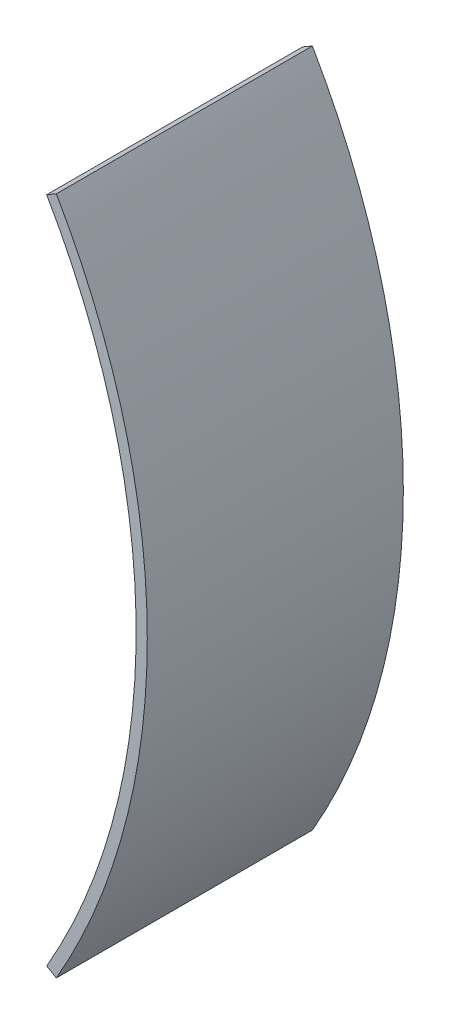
ISO-10303-21;
HEADER;
FILE_DESCRIPTION(('STEP AP214'),'2;1');
FILE_NAME('part.step','',(''),(''),'','','');
FILE_SCHEMA(('AUTOMOTIVE_DESIGN { 1 0 10303 214 1 1 1 1 }'));
ENDSEC;
DATA;
#1=APPLICATION_CONTEXT('core data for automotive mechanical design processes');
#2=APPLICATION_PROTOCOL_DEFINITION('international standard','automotive_design',2000,#1);
#3=PRODUCT_CONTEXT('',#1,'mechanical');
#4=PRODUCT('Part','Part','',(#3));
#5=PRODUCT_RELATED_PRODUCT_CATEGORY('part','',(#4));
#6=PRODUCT_DEFINITION_FORMATION('','',#4);
#7=PRODUCT_DEFINITION_CONTEXT('part definition',#1,'design');
#8=PRODUCT_DEFINITION('design','',#6,#7);
#9=PRODUCT_DEFINITION_SHAPE('','',#8);
#10=(LENGTH_UNIT() NAMED_UNIT(*) SI_UNIT(.MILLI.,.METRE.));
#11=(NAMED_UNIT(*) PLANE_ANGLE_UNIT() SI_UNIT($,.RADIAN.));
#12=(NAMED_UNIT(*) SI_UNIT($,.STERADIAN.) SOLID_ANGLE_UNIT());
#13=UNCERTAINTY_MEASURE_WITH_UNIT(LENGTH_MEASURE(1.E-05),#10,'distance_accuracy_value','');
#14=(GEOMETRIC_REPRESENTATION_CONTEXT(3) GLOBAL_UNCERTAINTY_ASSIGNED_CONTEXT((#13)) GLOBAL_UNIT_ASSIGNED_CONTEXT((#10,
#11,#12)) REPRESENTATION_CONTEXT('',''));
#15=CARTESIAN_POINT('',(0.,0.,0.));
#16=DIRECTION('',(0.,0.,1.));
#17=DIRECTION('',(1.,0.,0.));
#18=AXIS2_PLACEMENT_3D('',#15,#16,#17);
#19=CARTESIAN_POINT('',(0.,0.,0.));
#20=DIRECTION('',(0.,0.,1.));
#21=DIRECTION('',(1.,0.,0.));
#22=AXIS2_PLACEMENT_3D('',#19,#20,#21);
#23=PLANE('',#22);
#24=CARTESIAN_POINT('',(297.32137494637,-40.,0.));
#25=DIRECTION('',(0.,0.,1.));
#26=DIRECTION('',(1.,0.,0.));
#27=AXIS2_PLACEMENT_3D('',#24,#25,#26);
#28=CIRCLE('',#27,4.50000000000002);
#29=CARTESIAN_POINT('',(299.815936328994,-36.2547144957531,0.));
#30=VERTEX_POINT('',#29);
#31=CARTESIAN_POINT('',(295.84806800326,-35.748016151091,0.));
#32=VERTEX_POINT('',#31);
#33=EDGE_CURVE('E259',#30,#32,#28,.T.);
#34=ORIENTED_EDGE('',*,*,#33,.F.);
#35=CARTESIAN_POINT('',(0.,0.,0.));
#36=DIRECTION('',(0.,0.,1.));
#37=DIRECTION('',(1.,0.,0.));
#38=AXIS2_PLACEMENT_3D('',#35,#36,#37);
#39=CIRCLE('',#38,302.);
#40=CARTESIAN_POINT('',(299.815936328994,36.2547144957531,0.));
#41=VERTEX_POINT('',#40);
#42=EDGE_CURVE('E282',#30,#41,#39,.T.);
#43=ORIENTED_EDGE('',*,*,#42,.T.);
#44=CARTESIAN_POINT('',(297.32137494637,40.,0.));
#45=DIRECTION('',(0.,0.,1.));
#46=DIRECTION('',(1.,0.,0.));
#47=AXIS2_PLACEMENT_3D('',#44,#45,#46);
#48=CIRCLE('',#47,4.50000000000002);
#49=CARTESIAN_POINT('',(295.84806800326,35.748016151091,0.));
#50=VERTEX_POINT('',#49);
#51=EDGE_CURVE('E286',#50,#41,#48,.T.);
#52=ORIENTED_EDGE('',*,*,#51,.F.);
#53=CARTESIAN_POINT('',(0.,0.,0.));
#54=DIRECTION('',(0.,0.,1.));
#55=DIRECTION('',(1.,0.,0.));
#56=AXIS2_PLACEMENT_3D('',#53,#54,#55);
#57=CIRCLE('',#56,298.);
#58=EDGE_CURVE('E276',#50,#32,#57,.F.);
#59=ORIENTED_EDGE('',*,*,#58,.T.);
#60=EDGE_LOOP('',(#34,#43,#52,#59));
#61=FACE_BOUND('',#60,.T.);
#62=CARTESIAN_POINT('',(297.32137494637,40.,0.));
#63=DIRECTION('',(0.,0.,1.));
#64=DIRECTION('',(1.,0.,0.));
#65=AXIS2_PLACEMENT_3D('',#62,#63,#64);
#66=CIRCLE('',#65,1.50000000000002);
#67=CARTESIAN_POINT('',(298.82137494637,40.,0.));
#68=VERTEX_POINT('',#67);
#69=EDGE_CURVE('E318',#68,#68,#66,.T.);
#70=ORIENTED_EDGE('',*,*,#69,.T.);
#71=EDGE_LOOP('',(#70));
#72=FACE_BOUND('',#71,.T.);
#73=CARTESIAN_POINT('',(0.,0.,0.));
#74=DIRECTION('',(0.,0.,1.));
#75=DIRECTION('',(1.,0.,0.));
#76=AXIS2_PLACEMENT_3D('',#73,#74,#75);
#77=CIRCLE('',#76,300.);
#78=CARTESIAN_POINT('',(292.653012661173,-65.9864696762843,0.));
#79=VERTEX_POINT('',#78);
#80=CARTESIAN_POINT('',(259.807621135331,-150.,0.));
#81=VERTEX_POINT('',#80);
#82=EDGE_CURVE('E211',#79,#81,#77,.F.);
#83=ORIENTED_EDGE('',*,*,#82,.F.);
#84=CARTESIAN_POINT('',(287.775462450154,-64.8866951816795,0.));
#85=DIRECTION('',(0.,0.,1.));
#86=DIRECTION('',(1.,0.,0.));
#87=AXIS2_PLACEMENT_3D('',#84,#85,#86);
#88=CIRCLE('',#87,5.);
#89=CARTESIAN_POINT('',(288.833862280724,-60.,0.));
#90=VERTEX_POINT('',#89);
#91=EDGE_CURVE('E339',#79,#90,#88,.T.);
#92=ORIENTED_EDGE('',*,*,#91,.T.);
#93=CARTESIAN_POINT('',(0.,0.,0.));
#94=DIRECTION('',(0.,0.,-1.));
#95=DIRECTION('',(-1.,0.,0.));
#96=AXIS2_PLACEMENT_3D('',#93,#94,#95);
#97=CIRCLE('',#96,295.);
#98=CARTESIAN_POINT('',(288.833862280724,60.,0.));
#99=VERTEX_POINT('',#98);
#100=EDGE_CURVE('E305',#99,#90,#97,.T.);
#101=ORIENTED_EDGE('',*,*,#100,.F.);
#102=CARTESIAN_POINT('',(287.775462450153,64.8866951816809,0.));
#103=DIRECTION('',(0.,0.,1.));
#104=DIRECTION('',(1.,0.,0.));
#105=AXIS2_PLACEMENT_3D('',#102,#103,#104);
#106=CIRCLE('',#105,5.);
#107=CARTESIAN_POINT('',(292.653012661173,65.9864696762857,0.));
#108=VERTEX_POINT('',#107);
#109=EDGE_CURVE('E11',#99,#108,#106,.T.);
#110=ORIENTED_EDGE('',*,*,#109,.T.);
#111=CARTESIAN_POINT('',(0.,0.,0.));
#112=DIRECTION('',(0.,0.,1.));
#113=DIRECTION('',(1.,0.,0.));
#114=AXIS2_PLACEMENT_3D('',#111,#112,#113);
#115=CIRCLE('',#114,300.);
#116=CARTESIAN_POINT('',(259.807621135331,150.,0.));
#117=VERTEX_POINT('',#116);
#118=EDGE_CURVE('E186',#117,#108,#115,.F.);
#119=ORIENTED_EDGE('',*,*,#118,.F.);
#120=DIRECTION('',(-0.866025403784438,-0.5,0.));
#121=VECTOR('',#120,1.);
#122=CARTESIAN_POINT('',(259.807621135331,150.,0.));
#123=LINE('',#122,#121);
#124=CARTESIAN_POINT('',(264.137748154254,152.5,0.));
#125=VERTEX_POINT('',#124);
#126=EDGE_CURVE('E201',#125,#117,#123,.T.);
#127=ORIENTED_EDGE('',*,*,#126,.F.);
#128=CARTESIAN_POINT('',(0.,0.,0.));
#129=DIRECTION('',(0.,0.,1.));
#130=DIRECTION('',(1.,0.,0.));
#131=AXIS2_PLACEMENT_3D('',#128,#129,#130);
#132=CIRCLE('',#131,305.);
#133=CARTESIAN_POINT('',(264.137748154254,-152.5,0.));
#134=VERTEX_POINT('',#133);
#135=EDGE_CURVE('E325',#134,#125,#132,.T.);
#136=ORIENTED_EDGE('',*,*,#135,.F.);
#137=DIRECTION('',(0.866025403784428,-0.500000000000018,0.));
#138=VECTOR('',#137,1.);
#139=CARTESIAN_POINT('',(264.137748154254,-152.5,0.));
#140=LINE('',#139,#138);
#141=EDGE_CURVE('E204',#81,#134,#140,.T.);
#142=ORIENTED_EDGE('',*,*,#141,.F.);
#143=EDGE_LOOP('',(#83,#92,#101,#110,#119,#127,#136,#142));
#144=FACE_BOUND('',#143,.T.);
#145=CARTESIAN_POINT('',(297.32137494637,-40.,0.));
#146=DIRECTION('',(0.,0.,1.));
#147=DIRECTION('',(-1.,0.,0.));
#148=AXIS2_PLACEMENT_3D('',#145,#146,#147);
#149=CIRCLE('',#148,1.50000000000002);
#150=CARTESIAN_POINT('',(295.82137494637,-40.,0.));
#151=VERTEX_POINT('',#150);
#152=EDGE_CURVE('E314',#151,#151,#149,.T.);
#153=ORIENTED_EDGE('',*,*,#152,.T.);
#154=EDGE_LOOP('',(#153));
#155=FACE_BOUND('',#154,.T.);
#156=CARTESIAN_POINT('',(294.776713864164,-43.7114282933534,0.));
#157=VERTEX_POINT('',#156);
#158=CARTESIAN_POINT('',(298.737415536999,-44.271396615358,0.));
#159=VERTEX_POINT('',#158);
#160=EDGE_CURVE('E261',#157,#159,#28,.T.);
#161=ORIENTED_EDGE('',*,*,#160,.F.);
#162=CARTESIAN_POINT('',(292.497863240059,-57.,0.));
#163=VERTEX_POINT('',#162);
#164=EDGE_CURVE('E273',#157,#163,#57,.F.);
#165=ORIENTED_EDGE('',*,*,#164,.T.);
#166=DIRECTION('',(1.,0.,0.));
#167=VECTOR('',#166,1.);
#168=CARTESIAN_POINT('',(72.3602100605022,-57.,0.));
#169=LINE('',#168,#167);
#170=CARTESIAN_POINT('',(296.572082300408,-57.,0.));
#171=VERTEX_POINT('',#170);
#172=EDGE_CURVE('E253',#163,#171,#169,.T.);
#173=ORIENTED_EDGE('',*,*,#172,.T.);
#174=EDGE_CURVE('E272',#171,#159,#39,.T.);
#175=ORIENTED_EDGE('',*,*,#174,.T.);
#176=EDGE_LOOP('',(#161,#165,#173,#175));
#177=FACE_BOUND('',#176,.T.);
#178=CARTESIAN_POINT('',(298.737415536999,44.271396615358,0.));
#179=VERTEX_POINT('',#178);
#180=CARTESIAN_POINT('',(294.776713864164,43.7114282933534,0.));
#181=VERTEX_POINT('',#180);
#182=EDGE_CURVE('E283',#179,#181,#48,.T.);
#183=ORIENTED_EDGE('',*,*,#182,.F.);
#184=CARTESIAN_POINT('',(296.572082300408,57.,0.));
#185=VERTEX_POINT('',#184);
#186=EDGE_CURVE('E279',#179,#185,#39,.T.);
#187=ORIENTED_EDGE('',*,*,#186,.T.);
#188=DIRECTION('',(-1.,0.,0.));
#189=VECTOR('',#188,1.);
#190=CARTESIAN_POINT('',(72.3602100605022,57.,0.));
#191=LINE('',#190,#189);
#192=CARTESIAN_POINT('',(292.497863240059,57.,0.));
#193=VERTEX_POINT('',#192);
#194=EDGE_CURVE('E241',#185,#193,#191,.T.);
#195=ORIENTED_EDGE('',*,*,#194,.T.);
#196=EDGE_CURVE('E231',#193,#181,#57,.F.);
#197=ORIENTED_EDGE('',*,*,#196,.T.);
#198=EDGE_LOOP('',(#183,#187,#195,#197));
#199=FACE_BOUND('',#198,.T.);
#200=ADVANCED_FACE('F33',(#61,#72,#144,#155,#177,#199),#23,.F.);
#201=CARTESIAN_POINT('',(0.,0.,15.));
#202=DIRECTION('',(0.,0.,1.));
#203=DIRECTION('',(1.,0.,0.));
#204=AXIS2_PLACEMENT_3D('',#201,#202,#203);
#205=PLANE('',#204);
#206=CARTESIAN_POINT('',(0.,0.,15.));
#207=DIRECTION('',(0.,0.,-1.));
#208=DIRECTION('',(1.,0.,0.));
#209=AXIS2_PLACEMENT_3D('',#206,#207,#208);
#210=CIRCLE('',#209,300.);
#211=CARTESIAN_POINT('',(292.653012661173,65.9864696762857,15.));
#212=VERTEX_POINT('',#211);
#213=CARTESIAN_POINT('',(297.117659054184,41.4861022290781,15.));
#214=VERTEX_POINT('',#213);
#215=EDGE_CURVE('E56',#212,#214,#210,.T.);
#216=ORIENTED_EDGE('',*,*,#215,.F.);
#217=CARTESIAN_POINT('',(287.775462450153,64.8866951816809,15.));
#218=DIRECTION('',(0.,0.,1.));
#219=DIRECTION('',(1.,0.,0.));
#220=AXIS2_PLACEMENT_3D('',#217,#218,#219);
#221=CIRCLE('',#220,5.);
#222=CARTESIAN_POINT('',(288.833862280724,60.,15.));
#223=VERTEX_POINT('',#222);
#224=EDGE_CURVE('E41',#212,#223,#221,.F.);
#225=ORIENTED_EDGE('',*,*,#224,.T.);
#226=CARTESIAN_POINT('',(0.,0.,15.));
#227=DIRECTION('',(0.,0.,-1.));
#228=DIRECTION('',(-1.,0.,0.));
#229=AXIS2_PLACEMENT_3D('',#226,#227,#228);
#230=CIRCLE('',#229,295.);
#231=CARTESIAN_POINT('',(288.833862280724,-60.,15.));
#232=VERTEX_POINT('',#231);
#233=EDGE_CURVE('E306',#223,#232,#230,.T.);
#234=ORIENTED_EDGE('',*,*,#233,.T.);
#235=CARTESIAN_POINT('',(287.775462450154,-64.8866951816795,15.));
#236=DIRECTION('',(0.,0.,1.));
#237=DIRECTION('',(1.,0.,0.));
#238=AXIS2_PLACEMENT_3D('',#235,#236,#237);
#239=CIRCLE('',#238,5.);
#240=CARTESIAN_POINT('',(292.653012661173,-65.9864696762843,15.));
#241=VERTEX_POINT('',#240);
#242=EDGE_CURVE('E337',#232,#241,#239,.F.);
#243=ORIENTED_EDGE('',*,*,#242,.T.);
#244=CARTESIAN_POINT('',(297.117659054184,-41.4861022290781,15.));
#245=VERTEX_POINT('',#244);
#246=EDGE_CURVE('E48',#245,#241,#210,.T.);
#247=ORIENTED_EDGE('',*,*,#246,.F.);
#248=CARTESIAN_POINT('',(297.32137494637,-40.,15.));
#249=DIRECTION('',(0.,0.,1.));
#250=DIRECTION('',(-1.,0.,0.));
#251=AXIS2_PLACEMENT_3D('',#248,#249,#250);
#252=CIRCLE('',#251,1.50000000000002);
#253=CARTESIAN_POINT('',(297.517657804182,-38.5128977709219,15.));
#254=VERTEX_POINT('',#253);
#255=EDGE_CURVE('E319',#254,#245,#252,.T.);
#256=ORIENTED_EDGE('',*,*,#255,.F.);
#257=CARTESIAN_POINT('',(297.517657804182,38.5128977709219,15.));
#258=VERTEX_POINT('',#257);
#259=EDGE_CURVE('E349',#258,#254,#210,.T.);
#260=ORIENTED_EDGE('',*,*,#259,.F.);
#261=CARTESIAN_POINT('',(297.32137494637,40.,15.));
#262=DIRECTION('',(0.,0.,1.));
#263=DIRECTION('',(1.,0.,0.));
#264=AXIS2_PLACEMENT_3D('',#261,#262,#263);
#265=CIRCLE('',#264,1.50000000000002);
#266=EDGE_CURVE('E322',#214,#258,#265,.T.);
#267=ORIENTED_EDGE('',*,*,#266,.F.);
#268=EDGE_LOOP('',(#216,#225,#234,#243,#247,#256,#260,#267));
#269=FACE_BOUND('',#268,.T.);
#270=ADVANCED_FACE('F341',(#269),#205,.T.);
#271=CARTESIAN_POINT('',(0.,0.,15.));
#272=DIRECTION('',(0.,0.,-1.));
#273=DIRECTION('',(-1.,0.,0.));
#274=AXIS2_PLACEMENT_3D('',#271,#272,#273);
#275=CYLINDRICAL_SURFACE('',#274,305.);
#276=ORIENTED_EDGE('',*,*,#135,.T.);
#277=DIRECTION('',(0.,0.,-1.));
#278=VECTOR('',#277,1.);
#279=CARTESIAN_POINT('',(264.137748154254,152.5,115.));
#280=LINE('',#279,#278);
#281=CARTESIAN_POINT('',(264.137748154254,152.5,115.));
#282=VERTEX_POINT('',#281);
#283=EDGE_CURVE('E194',#282,#125,#280,.T.);
#284=ORIENTED_EDGE('',*,*,#283,.F.);
#285=CARTESIAN_POINT('',(0.,0.,115.));
#286=DIRECTION('',(0.,0.,1.));
#287=DIRECTION('',(1.,0.,0.));
#288=AXIS2_PLACEMENT_3D('',#285,#286,#287);
#289=CIRCLE('',#288,305.);
#290=CARTESIAN_POINT('',(264.137748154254,-152.5,115.));
#291=VERTEX_POINT('',#290);
#292=EDGE_CURVE('E220',#291,#282,#289,.T.);
#293=ORIENTED_EDGE('',*,*,#292,.F.);
#294=DIRECTION('',(0.,0.,-1.));
#295=VECTOR('',#294,1.);
#296=CARTESIAN_POINT('',(264.137748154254,-152.5,115.));
#297=LINE('',#296,#295);
#298=EDGE_CURVE('E225',#291,#134,#297,.T.);
#299=ORIENTED_EDGE('',*,*,#298,.T.);
#300=EDGE_LOOP('',(#276,#284,#293,#299));
#301=FACE_BOUND('',#300,.T.);
#302=ADVANCED_FACE('F384',(#301),#275,.T.);
#303=CARTESIAN_POINT('',(297.32137494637,40.,15.));
#304=DIRECTION('',(0.,0.,-1.));
#305=DIRECTION('',(-1.,0.,0.));
#306=AXIS2_PLACEMENT_3D('',#303,#304,#305);
#307=CYLINDRICAL_SURFACE('',#306,1.50000000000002);
#308=ORIENTED_EDGE('',*,*,#266,.T.);
#309=EDGE_CURVE('E326',#258,#214,#265,.T.);
#310=ORIENTED_EDGE('',*,*,#309,.T.);
#311=EDGE_LOOP('',(#308,#310));
#312=FACE_BOUND('',#311,.T.);
#313=ORIENTED_EDGE('',*,*,#69,.F.);
#314=EDGE_LOOP('',(#313));
#315=FACE_BOUND('',#314,.T.);
#316=ADVANCED_FACE('F354',(#312,#315),#307,.F.);
#317=CARTESIAN_POINT('',(297.32137494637,-40.,15.));
#318=DIRECTION('',(0.,0.,-1.));
#319=DIRECTION('',(-1.,0.,0.));
#320=AXIS2_PLACEMENT_3D('',#317,#318,#319);
#321=CYLINDRICAL_SURFACE('',#320,1.50000000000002);
#322=EDGE_CURVE('E315',#245,#254,#252,.T.);
#323=ORIENTED_EDGE('',*,*,#322,.T.);
#324=ORIENTED_EDGE('',*,*,#255,.T.);
#325=EDGE_LOOP('',(#323,#324));
#326=FACE_BOUND('',#325,.T.);
#327=ORIENTED_EDGE('',*,*,#152,.F.);
#328=EDGE_LOOP('',(#327));
#329=FACE_BOUND('',#328,.T.);
#330=ADVANCED_FACE('F447',(#326,#329),#321,.F.);
#331=CARTESIAN_POINT('',(0.,0.,15.));
#332=DIRECTION('',(0.,0.,-1.));
#333=DIRECTION('',(-1.,0.,0.));
#334=AXIS2_PLACEMENT_3D('',#331,#332,#333);
#335=CYLINDRICAL_SURFACE('',#334,295.);
#336=ORIENTED_EDGE('',*,*,#233,.F.);
#337=DIRECTION('',(0.,0.,-1.));
#338=VECTOR('',#337,1.);
#339=CARTESIAN_POINT('',(288.833862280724,60.,15.));
#340=LINE('',#339,#338);
#341=EDGE_CURVE('E330',#99,#223,#340,.F.);
#342=ORIENTED_EDGE('',*,*,#341,.F.);
#343=ORIENTED_EDGE('',*,*,#100,.T.);
#344=DIRECTION('',(0.,0.,-1.));
#345=VECTOR('',#344,1.);
#346=CARTESIAN_POINT('',(288.833862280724,-60.,15.));
#347=LINE('',#346,#345);
#348=EDGE_CURVE('E309',#232,#90,#347,.T.);
#349=ORIENTED_EDGE('',*,*,#348,.F.);
#350=EDGE_LOOP('',(#336,#342,#343,#349));
#351=FACE_BOUND('',#350,.T.);
#352=ADVANCED_FACE('F345',(#351),#335,.F.);
#353=CARTESIAN_POINT('',(297.32137494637,40.,15.));
#354=DIRECTION('',(0.,0.,-1.));
#355=DIRECTION('',(-1.,0.,0.));
#356=AXIS2_PLACEMENT_3D('',#353,#354,#355);
#357=CYLINDRICAL_SURFACE('',#356,4.50000000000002);
#358=CARTESIAN_POINT('',(297.32137494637,40.,12.));
#359=DIRECTION('',(0.,0.,1.));
#360=DIRECTION('',(1.,0.,0.));
#361=AXIS2_PLACEMENT_3D('',#358,#359,#360);
#362=CIRCLE('',#361,4.50000000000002);
#363=CARTESIAN_POINT('',(295.848068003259,35.7480161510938,12.));
#364=VERTEX_POINT('',#363);
#365=CARTESIAN_POINT('',(299.815936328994,36.2547144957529,12.));
#366=VERTEX_POINT('',#365);
#367=EDGE_CURVE('E250',#364,#366,#362,.T.);
#368=ORIENTED_EDGE('',*,*,#367,.F.);
#369=DIRECTION('',(0.,0.,1.));
#370=VECTOR('',#369,1.);
#371=CARTESIAN_POINT('',(295.84806800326,35.7480161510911,15.));
#372=LINE('',#371,#370);
#373=EDGE_CURVE('E296',#364,#50,#372,.F.);
#374=ORIENTED_EDGE('',*,*,#373,.T.);
#375=ORIENTED_EDGE('',*,*,#51,.T.);
#376=DIRECTION('',(0.,0.,-1.));
#377=VECTOR('',#376,1.);
#378=CARTESIAN_POINT('',(299.815936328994,36.2547144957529,15.));
#379=LINE('',#378,#377);
#380=EDGE_CURVE('E300',#366,#41,#379,.T.);
#381=ORIENTED_EDGE('',*,*,#380,.F.);
#382=EDGE_LOOP('',(#368,#374,#375,#381));
#383=FACE_BOUND('',#382,.T.);
#384=ADVANCED_FACE('F371',(#383),#357,.T.);
#385=CARTESIAN_POINT('',(0.,0.,12.));
#386=DIRECTION('',(0.,0.,1.));
#387=DIRECTION('',(1.,0.,0.));
#388=AXIS2_PLACEMENT_3D('',#385,#386,#387);
#389=PLANE('',#388);
#390=CARTESIAN_POINT('',(0.,0.,12.));
#391=DIRECTION('',(0.,0.,1.));
#392=DIRECTION('',(1.,0.,0.));
#393=AXIS2_PLACEMENT_3D('',#390,#391,#392);
#394=CIRCLE('',#393,298.);
#395=CARTESIAN_POINT('',(295.84806800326,-35.748016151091,12.));
#396=VERTEX_POINT('',#395);
#397=EDGE_CURVE('E236',#364,#396,#394,.F.);
#398=ORIENTED_EDGE('',*,*,#397,.F.);
#399=ORIENTED_EDGE('',*,*,#367,.T.);
#400=CARTESIAN_POINT('',(0.,0.,12.));
#401=DIRECTION('',(0.,0.,1.));
#402=DIRECTION('',(1.,0.,0.));
#403=AXIS2_PLACEMENT_3D('',#400,#401,#402);
#404=CIRCLE('',#403,302.);
#405=CARTESIAN_POINT('',(299.815936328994,-36.2547144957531,12.));
#406=VERTEX_POINT('',#405);
#407=EDGE_CURVE('E246',#406,#366,#404,.T.);
#408=ORIENTED_EDGE('',*,*,#407,.F.);
#409=CARTESIAN_POINT('',(297.32137494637,-40.,12.));
#410=DIRECTION('',(0.,0.,1.));
#411=DIRECTION('',(1.,0.,0.));
#412=AXIS2_PLACEMENT_3D('',#409,#410,#411);
#413=CIRCLE('',#412,4.50000000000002);
#414=EDGE_CURVE('E255',#406,#396,#413,.T.);
#415=ORIENTED_EDGE('',*,*,#414,.T.);
#416=EDGE_LOOP('',(#398,#399,#408,#415));
#417=FACE_BOUND('',#416,.T.);
#418=ADVANCED_FACE('F413',(#417),#389,.F.);
#419=CARTESIAN_POINT('',(0.,0.,15.));
#420=DIRECTION('',(0.,0.,-1.));
#421=DIRECTION('',(-1.,0.,0.));
#422=AXIS2_PLACEMENT_3D('',#419,#420,#421);
#423=CYLINDRICAL_SURFACE('',#422,298.);
#424=ORIENTED_EDGE('',*,*,#397,.T.);
#425=DIRECTION('',(0.,0.,1.));
#426=VECTOR('',#425,1.);
#427=CARTESIAN_POINT('',(295.848068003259,-35.7480161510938,15.));
#428=LINE('',#427,#426);
#429=EDGE_CURVE('E290',#396,#32,#428,.F.);
#430=ORIENTED_EDGE('',*,*,#429,.T.);
#431=ORIENTED_EDGE('',*,*,#58,.F.);
#432=ORIENTED_EDGE('',*,*,#373,.F.);
#433=EDGE_LOOP('',(#424,#430,#431,#432));
#434=FACE_BOUND('',#433,.T.);
#435=ADVANCED_FACE('F416',(#434),#423,.T.);
#436=CARTESIAN_POINT('',(0.,0.,15.));
#437=DIRECTION('',(0.,0.,-1.));
#438=DIRECTION('',(-1.,0.,0.));
#439=AXIS2_PLACEMENT_3D('',#436,#437,#438);
#440=CYLINDRICAL_SURFACE('',#439,302.);
#441=ORIENTED_EDGE('',*,*,#380,.T.);
#442=ORIENTED_EDGE('',*,*,#42,.F.);
#443=DIRECTION('',(0.,0.,-1.));
#444=VECTOR('',#443,1.);
#445=CARTESIAN_POINT('',(299.815936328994,-36.2547144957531,15.));
#446=LINE('',#445,#444);
#447=EDGE_CURVE('E294',#406,#30,#446,.T.);
#448=ORIENTED_EDGE('',*,*,#447,.F.);
#449=ORIENTED_EDGE('',*,*,#407,.T.);
#450=EDGE_LOOP('',(#441,#442,#448,#449));
#451=FACE_BOUND('',#450,.T.);
#452=ADVANCED_FACE('F429',(#451),#440,.F.);
#453=CARTESIAN_POINT('',(297.32137494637,-40.,15.));
#454=DIRECTION('',(0.,0.,-1.));
#455=DIRECTION('',(-1.,0.,0.));
#456=AXIS2_PLACEMENT_3D('',#453,#454,#455);
#457=CYLINDRICAL_SURFACE('',#456,4.50000000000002);
#458=ORIENTED_EDGE('',*,*,#447,.T.);
#459=ORIENTED_EDGE('',*,*,#33,.T.);
#460=ORIENTED_EDGE('',*,*,#429,.F.);
#461=ORIENTED_EDGE('',*,*,#414,.F.);
#462=EDGE_LOOP('',(#458,#459,#460,#461));
#463=FACE_BOUND('',#462,.T.);
#464=ADVANCED_FACE('F440',(#463),#457,.T.);
#465=CARTESIAN_POINT('',(294.776713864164,-43.7114282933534,12.));
#466=VERTEX_POINT('',#465);
#467=CARTESIAN_POINT('',(298.737415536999,-44.271396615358,12.));
#468=VERTEX_POINT('',#467);
#469=EDGE_CURVE('E258',#466,#468,#413,.T.);
#470=ORIENTED_EDGE('',*,*,#469,.T.);
#471=CARTESIAN_POINT('',(296.572082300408,-57.,12.));
#472=VERTEX_POINT('',#471);
#473=EDGE_CURVE('E242',#472,#468,#404,.T.);
#474=ORIENTED_EDGE('',*,*,#473,.F.);
#475=DIRECTION('',(1.,0.,0.));
#476=VECTOR('',#475,1.);
#477=CARTESIAN_POINT('',(72.3602100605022,-57.,12.));
#478=LINE('',#477,#476);
#479=CARTESIAN_POINT('',(292.497863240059,-57.,12.));
#480=VERTEX_POINT('',#479);
#481=EDGE_CURVE('E238',#480,#472,#478,.T.);
#482=ORIENTED_EDGE('',*,*,#481,.F.);
#483=EDGE_CURVE('E237',#466,#480,#394,.F.);
#484=ORIENTED_EDGE('',*,*,#483,.F.);
#485=EDGE_LOOP('',(#470,#474,#482,#484));
#486=FACE_BOUND('',#485,.T.);
#487=ADVANCED_FACE('F419',(#486),#389,.F.);
#488=CARTESIAN_POINT('',(72.3602100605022,-57.,15.));
#489=DIRECTION('',(0.,1.,0.));
#490=DIRECTION('',(0.,0.,1.));
#491=AXIS2_PLACEMENT_3D('',#488,#489,#490);
#492=PLANE('',#491);
#493=ORIENTED_EDGE('',*,*,#481,.T.);
#494=DIRECTION('',(0.,0.,-1.));
#495=VECTOR('',#494,1.);
#496=CARTESIAN_POINT('',(296.572082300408,-57.,12.));
#497=LINE('',#496,#495);
#498=EDGE_CURVE('E262',#472,#171,#497,.T.);
#499=ORIENTED_EDGE('',*,*,#498,.T.);
#500=ORIENTED_EDGE('',*,*,#172,.F.);
#501=DIRECTION('',(0.,0.,-1.));
#502=VECTOR('',#501,1.);
#503=CARTESIAN_POINT('',(292.497863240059,-57.,12.));
#504=LINE('',#503,#502);
#505=EDGE_CURVE('E235',#480,#163,#504,.T.);
#506=ORIENTED_EDGE('',*,*,#505,.F.);
#507=EDGE_LOOP('',(#493,#499,#500,#506));
#508=FACE_BOUND('',#507,.T.);
#509=ADVANCED_FACE('F420',(#508),#492,.T.);
#510=DIRECTION('',(0.,0.,-1.));
#511=VECTOR('',#510,1.);
#512=CARTESIAN_POINT('',(298.737415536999,-44.2713966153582,15.));
#513=LINE('',#512,#511);
#514=EDGE_CURVE('E292',#468,#159,#513,.T.);
#515=ORIENTED_EDGE('',*,*,#514,.T.);
#516=ORIENTED_EDGE('',*,*,#174,.F.);
#517=ORIENTED_EDGE('',*,*,#498,.F.);
#518=ORIENTED_EDGE('',*,*,#473,.T.);
#519=EDGE_LOOP('',(#515,#516,#517,#518));
#520=FACE_BOUND('',#519,.T.);
#521=ADVANCED_FACE('F423',(#520),#440,.F.);
#522=ORIENTED_EDGE('',*,*,#469,.F.);
#523=DIRECTION('',(0.,0.,1.));
#524=VECTOR('',#523,1.);
#525=CARTESIAN_POINT('',(294.776713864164,-43.7114282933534,15.));
#526=LINE('',#525,#524);
#527=EDGE_CURVE('E269',#466,#157,#526,.F.);
#528=ORIENTED_EDGE('',*,*,#527,.T.);
#529=ORIENTED_EDGE('',*,*,#160,.T.);
#530=ORIENTED_EDGE('',*,*,#514,.F.);
#531=EDGE_LOOP('',(#522,#528,#529,#530));
#532=FACE_BOUND('',#531,.T.);
#533=ADVANCED_FACE('F427',(#532),#457,.T.);
#534=ORIENTED_EDGE('',*,*,#483,.T.);
#535=ORIENTED_EDGE('',*,*,#505,.T.);
#536=ORIENTED_EDGE('',*,*,#164,.F.);
#537=ORIENTED_EDGE('',*,*,#527,.F.);
#538=EDGE_LOOP('',(#534,#535,#536,#537));
#539=FACE_BOUND('',#538,.T.);
#540=ADVANCED_FACE('F432',(#539),#423,.T.);
#541=CARTESIAN_POINT('',(72.3602100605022,57.,15.));
#542=DIRECTION('',(0.,-1.,0.));
#543=DIRECTION('',(0.,0.,-1.));
#544=AXIS2_PLACEMENT_3D('',#541,#542,#543);
#545=PLANE('',#544);
#546=ORIENTED_EDGE('',*,*,#194,.F.);
#547=DIRECTION('',(0.,0.,-1.));
#548=VECTOR('',#547,1.);
#549=CARTESIAN_POINT('',(296.572082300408,57.,12.));
#550=LINE('',#549,#548);
#551=CARTESIAN_POINT('',(296.572082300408,57.,12.));
#552=VERTEX_POINT('',#551);
#553=EDGE_CURVE('E249',#552,#185,#550,.T.);
#554=ORIENTED_EDGE('',*,*,#553,.F.);
#555=DIRECTION('',(-1.,0.,0.));
#556=VECTOR('',#555,1.);
#557=CARTESIAN_POINT('',(72.3602100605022,57.,12.));
#558=LINE('',#557,#556);
#559=CARTESIAN_POINT('',(292.497863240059,57.,12.));
#560=VERTEX_POINT('',#559);
#561=EDGE_CURVE('E245',#552,#560,#558,.T.);
#562=ORIENTED_EDGE('',*,*,#561,.T.);
#563=DIRECTION('',(0.,0.,-1.));
#564=VECTOR('',#563,1.);
#565=CARTESIAN_POINT('',(292.497863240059,57.,0.));
#566=LINE('',#565,#564);
#567=EDGE_CURVE('E264',#193,#560,#566,.F.);
#568=ORIENTED_EDGE('',*,*,#567,.F.);
#569=EDGE_LOOP('',(#546,#554,#562,#568));
#570=FACE_BOUND('',#569,.T.);
#571=ADVANCED_FACE('F430',(#570),#545,.T.);
#572=CARTESIAN_POINT('',(294.776713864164,43.7114282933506,12.));
#573=VERTEX_POINT('',#572);
#574=EDGE_CURVE('E232',#560,#573,#394,.F.);
#575=ORIENTED_EDGE('',*,*,#574,.F.);
#576=ORIENTED_EDGE('',*,*,#561,.F.);
#577=CARTESIAN_POINT('',(298.737415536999,44.2713966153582,12.));
#578=VERTEX_POINT('',#577);
#579=EDGE_CURVE('E240',#578,#552,#404,.T.);
#580=ORIENTED_EDGE('',*,*,#579,.F.);
#581=EDGE_CURVE('E254',#578,#573,#362,.T.);
#582=ORIENTED_EDGE('',*,*,#581,.T.);
#583=EDGE_LOOP('',(#575,#576,#580,#582));
#584=FACE_BOUND('',#583,.T.);
#585=ADVANCED_FACE('F418',(#584),#389,.F.);
#586=DIRECTION('',(0.,0.,1.));
#587=VECTOR('',#586,1.);
#588=CARTESIAN_POINT('',(294.776713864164,43.7114282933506,15.));
#589=LINE('',#588,#587);
#590=EDGE_CURVE('E298',#573,#181,#589,.F.);
#591=ORIENTED_EDGE('',*,*,#590,.T.);
#592=ORIENTED_EDGE('',*,*,#196,.F.);
#593=ORIENTED_EDGE('',*,*,#567,.T.);
#594=ORIENTED_EDGE('',*,*,#574,.T.);
#595=EDGE_LOOP('',(#591,#592,#593,#594));
#596=FACE_BOUND('',#595,.T.);
#597=ADVANCED_FACE('F444',(#596),#423,.T.);
#598=ORIENTED_EDGE('',*,*,#579,.T.);
#599=ORIENTED_EDGE('',*,*,#553,.T.);
#600=ORIENTED_EDGE('',*,*,#186,.F.);
#601=DIRECTION('',(0.,0.,-1.));
#602=VECTOR('',#601,1.);
#603=CARTESIAN_POINT('',(298.737415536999,44.271396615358,15.));
#604=LINE('',#603,#602);
#605=EDGE_CURVE('E303',#578,#179,#604,.T.);
#606=ORIENTED_EDGE('',*,*,#605,.F.);
#607=EDGE_LOOP('',(#598,#599,#600,#606));
#608=FACE_BOUND('',#607,.T.);
#609=ADVANCED_FACE('F368',(#608),#440,.F.);
#610=ORIENTED_EDGE('',*,*,#605,.T.);
#611=ORIENTED_EDGE('',*,*,#182,.T.);
#612=ORIENTED_EDGE('',*,*,#590,.F.);
#613=ORIENTED_EDGE('',*,*,#581,.F.);
#614=EDGE_LOOP('',(#610,#611,#612,#613));
#615=FACE_BOUND('',#614,.T.);
#616=ADVANCED_FACE('F359',(#615),#357,.T.);
#617=CARTESIAN_POINT('',(0.,0.,15.));
#618=DIRECTION('',(0.,0.,1.));
#619=DIRECTION('',(1.,0.,0.));
#620=AXIS2_PLACEMENT_3D('',#617,#618,#619);
#621=PLANE('',#620);
#622=ORIENTED_EDGE('',*,*,#309,.F.);
#623=EDGE_CURVE('E218',#214,#258,#210,.T.);
#624=ORIENTED_EDGE('',*,*,#623,.F.);
#625=EDGE_LOOP('',(#622,#624));
#626=FACE_BOUND('',#625,.T.);
#627=ADVANCED_FACE('F357',(#626),#621,.F.);
#628=CARTESIAN_POINT('',(0.,0.,115.));
#629=DIRECTION('',(0.,0.,-1.));
#630=DIRECTION('',(-1.,0.,0.));
#631=AXIS2_PLACEMENT_3D('',#628,#629,#630);
#632=CYLINDRICAL_SURFACE('',#631,300.);
#633=ORIENTED_EDGE('',*,*,#246,.T.);
#634=DIRECTION('',(0.,0.,-1.));
#635=VECTOR('',#634,1.);
#636=CARTESIAN_POINT('',(292.653012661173,-65.9864696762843,115.));
#637=LINE('',#636,#635);
#638=EDGE_CURVE('E335',#241,#79,#637,.T.);
#639=ORIENTED_EDGE('',*,*,#638,.T.);
#640=ORIENTED_EDGE('',*,*,#82,.T.);
#641=DIRECTION('',(0.,0.,-1.));
#642=VECTOR('',#641,1.);
#643=CARTESIAN_POINT('',(259.807621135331,-150.,115.));
#644=LINE('',#643,#642);
#645=CARTESIAN_POINT('',(259.807621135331,-150.,115.));
#646=VERTEX_POINT('',#645);
#647=EDGE_CURVE('E228',#646,#81,#644,.T.);
#648=ORIENTED_EDGE('',*,*,#647,.F.);
#649=CARTESIAN_POINT('',(0.,0.,115.));
#650=DIRECTION('',(0.,0.,-1.));
#651=DIRECTION('',(1.,0.,0.));
#652=AXIS2_PLACEMENT_3D('',#649,#650,#651);
#653=CIRCLE('',#652,300.);
#654=CARTESIAN_POINT('',(259.807621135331,150.,115.));
#655=VERTEX_POINT('',#654);
#656=EDGE_CURVE('E190',#655,#646,#653,.T.);
#657=ORIENTED_EDGE('',*,*,#656,.F.);
#658=DIRECTION('',(0.,0.,-1.));
#659=VECTOR('',#658,1.);
#660=CARTESIAN_POINT('',(259.807621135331,150.,115.));
#661=LINE('',#660,#659);
#662=EDGE_CURVE('E182',#655,#117,#661,.T.);
#663=ORIENTED_EDGE('',*,*,#662,.T.);
#664=ORIENTED_EDGE('',*,*,#118,.T.);
#665=DIRECTION('',(0.,0.,-1.));
#666=VECTOR('',#665,1.);
#667=CARTESIAN_POINT('',(292.653012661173,65.9864696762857,115.));
#668=LINE('',#667,#666);
#669=EDGE_CURVE('E333',#108,#212,#668,.F.);
#670=ORIENTED_EDGE('',*,*,#669,.T.);
#671=ORIENTED_EDGE('',*,*,#215,.T.);
#672=ORIENTED_EDGE('',*,*,#623,.T.);
#673=ORIENTED_EDGE('',*,*,#259,.T.);
#674=EDGE_CURVE('E213',#254,#245,#210,.T.);
#675=ORIENTED_EDGE('',*,*,#674,.T.);
#676=EDGE_LOOP('',(#633,#639,#640,#648,#657,#663,#664,#670,#671,#672,#673,#675));
#677=FACE_BOUND('',#676,.T.);
#678=ADVANCED_FACE('F184',(#677),#632,.F.);
#679=CARTESIAN_POINT('',(259.807621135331,-150.,115.));
#680=DIRECTION('',(0.5,0.866025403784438,0.));
#681=DIRECTION('',(-0.866025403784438,0.5,0.));
#682=AXIS2_PLACEMENT_3D('',#679,#680,#681);
#683=PLANE('',#682);
#684=ORIENTED_EDGE('',*,*,#647,.T.);
#685=ORIENTED_EDGE('',*,*,#141,.T.);
#686=ORIENTED_EDGE('',*,*,#298,.F.);
#687=DIRECTION('',(0.866025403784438,-0.5,0.));
#688=VECTOR('',#687,1.);
#689=CARTESIAN_POINT('',(259.807621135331,-150.,115.));
#690=LINE('',#689,#688);
#691=EDGE_CURVE('E217',#646,#291,#690,.T.);
#692=ORIENTED_EDGE('',*,*,#691,.F.);
#693=EDGE_LOOP('',(#684,#685,#686,#692));
#694=FACE_BOUND('',#693,.T.);
#695=ADVANCED_FACE('F366',(#694),#683,.F.);
#696=CARTESIAN_POINT('',(259.807621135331,150.,115.));
#697=DIRECTION('',(0.500000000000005,-0.866025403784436,0.));
#698=DIRECTION('',(0.866025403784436,0.500000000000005,0.));
#699=AXIS2_PLACEMENT_3D('',#696,#697,#698);
#700=PLANE('',#699);
#701=ORIENTED_EDGE('',*,*,#283,.T.);
#702=ORIENTED_EDGE('',*,*,#126,.T.);
#703=ORIENTED_EDGE('',*,*,#662,.F.);
#704=DIRECTION('',(-0.866025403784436,-0.500000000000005,0.));
#705=VECTOR('',#704,1.);
#706=CARTESIAN_POINT('',(259.807621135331,150.,115.));
#707=LINE('',#706,#705);
#708=EDGE_CURVE('E195',#282,#655,#707,.T.);
#709=ORIENTED_EDGE('',*,*,#708,.F.);
#710=EDGE_LOOP('',(#701,#702,#703,#709));
#711=FACE_BOUND('',#710,.T.);
#712=ADVANCED_FACE('F207',(#711),#700,.F.);
#713=CARTESIAN_POINT('',(0.,0.,115.));
#714=DIRECTION('',(0.,0.,1.));
#715=DIRECTION('',(1.,0.,0.));
#716=AXIS2_PLACEMENT_3D('',#713,#714,#715);
#717=PLANE('',#716);
#718=ORIENTED_EDGE('',*,*,#656,.T.);
#719=ORIENTED_EDGE('',*,*,#691,.T.);
#720=ORIENTED_EDGE('',*,*,#292,.T.);
#721=ORIENTED_EDGE('',*,*,#708,.T.);
#722=EDGE_LOOP('',(#718,#719,#720,#721));
#723=FACE_BOUND('',#722,.T.);
#724=ADVANCED_FACE('F376',(#723),#717,.T.);
#725=ORIENTED_EDGE('',*,*,#322,.F.);
#726=ORIENTED_EDGE('',*,*,#674,.F.);
#727=EDGE_LOOP('',(#725,#726));
#728=FACE_BOUND('',#727,.T.);
#729=ADVANCED_FACE('F361',(#728),#621,.F.);
#730=CARTESIAN_POINT('',(287.775462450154,-64.8866951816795,115.));
#731=DIRECTION('',(0.,0.,1.));
#732=DIRECTION('',(1.,0.,0.));
#733=AXIS2_PLACEMENT_3D('',#730,#731,#732);
#734=CYLINDRICAL_SURFACE('',#733,5.);
#735=ORIENTED_EDGE('',*,*,#91,.F.);
#736=ORIENTED_EDGE('',*,*,#638,.F.);
#737=ORIENTED_EDGE('',*,*,#242,.F.);
#738=ORIENTED_EDGE('',*,*,#348,.T.);
#739=EDGE_LOOP('',(#735,#736,#737,#738));
#740=FACE_BOUND('',#739,.T.);
#741=ADVANCED_FACE('F375',(#740),#734,.F.);
#742=CARTESIAN_POINT('',(287.775462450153,64.8866951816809,15.));
#743=DIRECTION('',(0.,0.,1.));
#744=DIRECTION('',(1.,0.,0.));
#745=AXIS2_PLACEMENT_3D('',#742,#743,#744);
#746=CYLINDRICAL_SURFACE('',#745,5.);
#747=ORIENTED_EDGE('',*,*,#109,.F.);
#748=ORIENTED_EDGE('',*,*,#341,.T.);
#749=ORIENTED_EDGE('',*,*,#224,.F.);
#750=ORIENTED_EDGE('',*,*,#669,.F.);
#751=EDGE_LOOP('',(#747,#748,#749,#750));
#752=FACE_BOUND('',#751,.T.);
#753=ADVANCED_FACE('F35',(#752),#746,.F.);
#754=CLOSED_SHELL('',(#200,#270,#302,#316,#330,#352,#384,#418,#435,#452,#464,#487,#509,#521,
#533,#540,#571,#585,#597,#609,#616,#627,#678,#695,#712,#724,#729,#741,#753));
#755=MANIFOLD_SOLID_BREP('B2',#754);
#756=ADVANCED_BREP_SHAPE_REPRESENTATION('',(#18,#755),#14);
#757=SHAPE_DEFINITION_REPRESENTATION(#9,#756);
ENDSEC;
END-ISO-10303-21;
